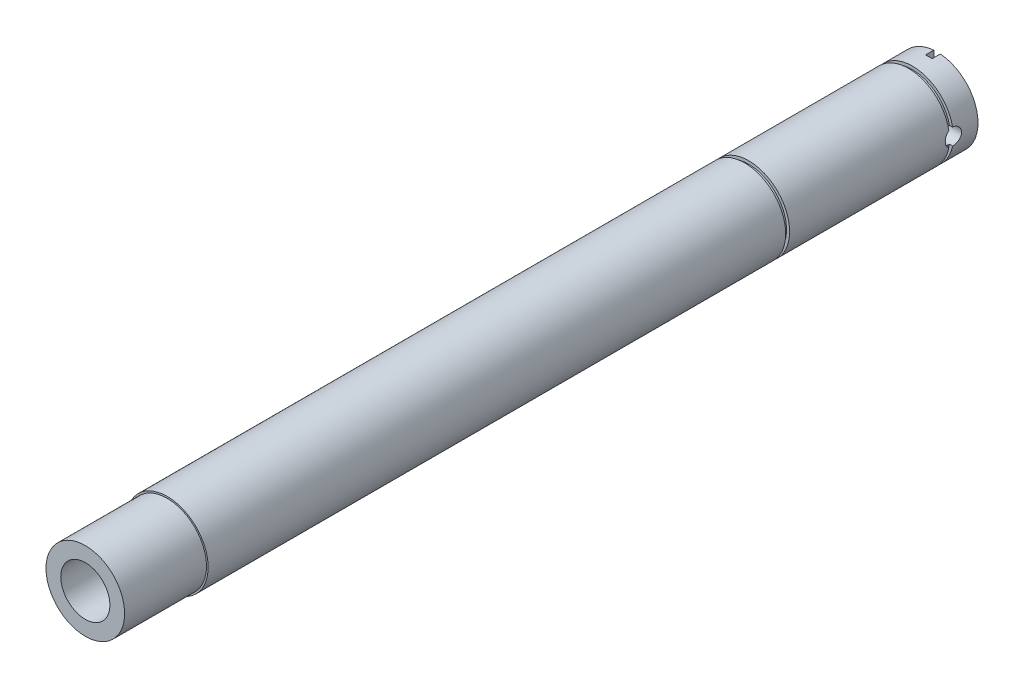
ISO-10303-21;
HEADER;
FILE_DESCRIPTION(('STEP AP214'),'2;1');
FILE_NAME('part.step','',(''),(''),'','','');
FILE_SCHEMA(('AUTOMOTIVE_DESIGN { 1 0 10303 214 1 1 1 1 }'));
ENDSEC;
DATA;
#1=APPLICATION_CONTEXT('core data for automotive mechanical design processes');
#2=APPLICATION_PROTOCOL_DEFINITION('international standard','automotive_design',2000,#1);
#3=PRODUCT_CONTEXT('',#1,'mechanical');
#4=PRODUCT('Part','Part','',(#3));
#5=PRODUCT_RELATED_PRODUCT_CATEGORY('part','',(#4));
#6=PRODUCT_DEFINITION_FORMATION('','',#4);
#7=PRODUCT_DEFINITION_CONTEXT('part definition',#1,'design');
#8=PRODUCT_DEFINITION('design','',#6,#7);
#9=PRODUCT_DEFINITION_SHAPE('','',#8);
#10=(LENGTH_UNIT() NAMED_UNIT(*) SI_UNIT(.MILLI.,.METRE.));
#11=(NAMED_UNIT(*) PLANE_ANGLE_UNIT() SI_UNIT($,.RADIAN.));
#12=(NAMED_UNIT(*) SI_UNIT($,.STERADIAN.) SOLID_ANGLE_UNIT());
#13=UNCERTAINTY_MEASURE_WITH_UNIT(LENGTH_MEASURE(1.E-05),#10,'distance_accuracy_value','');
#14=(GEOMETRIC_REPRESENTATION_CONTEXT(3) GLOBAL_UNCERTAINTY_ASSIGNED_CONTEXT((#13)) GLOBAL_UNIT_ASSIGNED_CONTEXT((#10,
#11,#12)) REPRESENTATION_CONTEXT('',''));
#15=CARTESIAN_POINT('',(0.,0.,0.));
#16=DIRECTION('',(0.,0.,1.));
#17=DIRECTION('',(1.,0.,0.));
#18=AXIS2_PLACEMENT_3D('',#15,#16,#17);
#19=CARTESIAN_POINT('',(-15.875,0.,-259.343504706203));
#20=DIRECTION('',(0.,0.,1.));
#21=DIRECTION('',(1.,0.,0.));
#22=AXIS2_PLACEMENT_3D('',#19,#20,#21);
#23=PLANE('',#22);
#24=DIRECTION('',(-1.,0.,0.));
#25=VECTOR('',#24,1.);
#26=CARTESIAN_POINT('',(-15.875,3.17499999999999,-259.343504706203));
#27=LINE('',#26,#25);
#28=CARTESIAN_POINT('',(15.5542598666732,3.17499999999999,-259.343504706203));
#29=VERTEX_POINT('',#28);
#30=CARTESIAN_POINT('',(14.3337716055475,3.17499999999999,-259.343504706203));
#31=VERTEX_POINT('',#30);
#32=EDGE_CURVE('E310',#29,#31,#27,.T.);
#33=ORIENTED_EDGE('',*,*,#32,.F.);
#34=CARTESIAN_POINT('',(0.,0.,-259.343504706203));
#35=DIRECTION('',(0.,0.,-1.));
#36=DIRECTION('',(-1.,0.,0.));
#37=AXIS2_PLACEMENT_3D('',#34,#35,#36);
#38=CIRCLE('',#37,15.875);
#39=CARTESIAN_POINT('',(-15.5542598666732,3.17499999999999,-259.343504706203));
#40=VERTEX_POINT('',#39);
#41=EDGE_CURVE('E237',#40,#29,#38,.T.);
#42=ORIENTED_EDGE('',*,*,#41,.F.);
#43=CARTESIAN_POINT('',(-14.3337716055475,3.17499999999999,-259.343504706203));
#44=VERTEX_POINT('',#43);
#45=EDGE_CURVE('E349',#44,#40,#27,.T.);
#46=ORIENTED_EDGE('',*,*,#45,.F.);
#47=CARTESIAN_POINT('',(0.,0.,-259.343504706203));
#48=DIRECTION('',(0.,0.,-1.));
#49=DIRECTION('',(-1.,0.,0.));
#50=AXIS2_PLACEMENT_3D('',#47,#48,#49);
#51=CIRCLE('',#50,14.6812);
#52=EDGE_CURVE('E229',#44,#31,#51,.T.);
#53=ORIENTED_EDGE('',*,*,#52,.T.);
#54=EDGE_LOOP('',(#33,#42,#46,#53));
#55=FACE_BOUND('',#54,.T.);
#56=ADVANCED_FACE('F48',(#55),#23,.T.);
#57=CARTESIAN_POINT('',(-15.875,0.,-257.819504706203));
#58=DIRECTION('',(0.,0.,-1.));
#59=DIRECTION('',(-1.,0.,0.));
#60=AXIS2_PLACEMENT_3D('',#57,#58,#59);
#61=PLANE('',#60);
#62=DIRECTION('',(-1.,0.,0.));
#63=VECTOR('',#62,1.);
#64=CARTESIAN_POINT('',(-15.875,-2.78532744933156,-257.819504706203));
#65=LINE('',#64,#63);
#66=CARTESIAN_POINT('',(15.6287419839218,-2.78532744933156,-257.819504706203));
#67=VERTEX_POINT('',#66);
#68=CARTESIAN_POINT('',(14.4145615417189,-2.78532744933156,-257.819504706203));
#69=VERTEX_POINT('',#68);
#70=EDGE_CURVE('E358',#67,#69,#65,.T.);
#71=ORIENTED_EDGE('',*,*,#70,.F.);
#72=CARTESIAN_POINT('',(0.,0.,-257.819504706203));
#73=DIRECTION('',(0.,0.,-1.));
#74=DIRECTION('',(-1.,0.,0.));
#75=AXIS2_PLACEMENT_3D('',#72,#73,#74);
#76=CIRCLE('',#75,15.875);
#77=CARTESIAN_POINT('',(-15.6287419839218,-2.78532744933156,-257.819504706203));
#78=VERTEX_POINT('',#77);
#79=EDGE_CURVE('E215',#67,#78,#76,.T.);
#80=ORIENTED_EDGE('',*,*,#79,.T.);
#81=CARTESIAN_POINT('',(-14.4145615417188,-2.78532744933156,-257.819504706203));
#82=VERTEX_POINT('',#81);
#83=EDGE_CURVE('E193',#82,#78,#65,.T.);
#84=ORIENTED_EDGE('',*,*,#83,.F.);
#85=CARTESIAN_POINT('',(0.,0.,-257.819504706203));
#86=DIRECTION('',(0.,0.,-1.));
#87=DIRECTION('',(-1.,0.,0.));
#88=AXIS2_PLACEMENT_3D('',#85,#86,#87);
#89=CIRCLE('',#88,14.6812);
#90=EDGE_CURVE('E214',#69,#82,#89,.T.);
#91=ORIENTED_EDGE('',*,*,#90,.F.);
#92=EDGE_LOOP('',(#71,#80,#84,#91));
#93=FACE_BOUND('',#92,.T.);
#94=ADVANCED_FACE('F336',(#93),#61,.T.);
#95=CARTESIAN_POINT('',(0.,0.,-317.264715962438));
#96=DIRECTION('',(0.,0.,-1.));
#97=DIRECTION('',(-1.,0.,0.));
#98=AXIS2_PLACEMENT_3D('',#95,#96,#97);
#99=CYLINDRICAL_SURFACE('',#98,14.6812);
#100=CARTESIAN_POINT('',(-14.4145615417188,2.78532744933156,-257.819504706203));
#101=CARTESIAN_POINT('',(-14.4063409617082,2.82785192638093,-257.897204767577));
#102=CARTESIAN_POINT('',(-14.3985594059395,2.86712987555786,-257.976731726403));
#103=CARTESIAN_POINT('',(-14.3840738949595,2.93894918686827,-258.13890725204));
#104=CARTESIAN_POINT('',(-14.3773704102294,2.97148760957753,-258.221557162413));
#105=CARTESIAN_POINT('',(-14.3653755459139,3.02893648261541,-258.387613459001));
#106=CARTESIAN_POINT('',(-14.3600574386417,3.05399293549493,-258.470967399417));
#107=CARTESIAN_POINT('',(-14.3508041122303,3.0971827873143,-258.639483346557));
#108=CARTESIAN_POINT('',(-14.3468682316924,3.11531949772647,-258.724644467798));
#109=CARTESIAN_POINT('',(-14.3404299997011,3.14482862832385,-258.897917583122));
#110=CARTESIAN_POINT('',(-14.3379574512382,3.15606058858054,-258.986054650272));
#111=CARTESIAN_POINT('',(-14.3346147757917,3.17119273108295,-259.163956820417));
#112=CARTESIAN_POINT('',(-14.333762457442,3.17501144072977,-259.253729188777));
#113=CARTESIAN_POINT('',(-14.3337716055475,3.17499999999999,-259.343504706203));
#114=B_SPLINE_CURVE_WITH_KNOTS('',3,(#100,#101,#102,#103,#104,#105,#106,#107,#108,#109,#110,
#111,#112,#113),.UNSPECIFIED.,.F.,.F.,(4,2,2,2,2,2,4),(0.,0.266795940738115,0.53370799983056,
0.795007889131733,1.05618257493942,1.3225081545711,1.59174447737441),.UNSPECIFIED.);
#115=CARTESIAN_POINT('',(-14.4145615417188,2.78532744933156,-257.819504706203));
#116=VERTEX_POINT('',#115);
#117=EDGE_CURVE('E282',#116,#44,#114,.T.);
#118=ORIENTED_EDGE('',*,*,#117,.F.);
#119=CARTESIAN_POINT('',(14.4145615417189,2.78532744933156,-257.819504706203));
#120=VERTEX_POINT('',#119);
#121=EDGE_CURVE('E206',#116,#120,#89,.T.);
#122=ORIENTED_EDGE('',*,*,#121,.T.);
#123=CARTESIAN_POINT('',(14.3337716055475,3.17499999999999,-259.343504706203));
#124=CARTESIAN_POINT('',(14.3337626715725,3.17501121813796,-259.254547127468));
#125=CARTESIAN_POINT('',(14.3345994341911,3.17126185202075,-259.165591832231));
#126=CARTESIAN_POINT('',(14.3379000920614,3.15632099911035,-258.988317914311));
#127=CARTESIAN_POINT('',(14.3403643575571,3.14512781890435,-258.899999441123));
#128=CARTESIAN_POINT('',(14.3467880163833,3.11568866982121,-258.726500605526));
#129=CARTESIAN_POINT('',(14.3507151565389,3.09759465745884,-258.641293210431));
#130=CARTESIAN_POINT('',(14.3599489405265,3.05450261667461,-258.472757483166));
#131=CARTESIAN_POINT('',(14.3652550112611,3.02950745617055,-258.389428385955));
#132=CARTESIAN_POINT('',(14.3772164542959,2.97223132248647,-258.223542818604));
#133=CARTESIAN_POINT('',(14.3838966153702,2.93981504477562,-258.141034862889));
#134=CARTESIAN_POINT('',(14.3984147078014,2.86785989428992,-257.978210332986));
#135=CARTESIAN_POINT('',(14.4062644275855,2.82824747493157,-257.897927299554));
#136=CARTESIAN_POINT('',(14.4145615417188,2.78532744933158,-257.819504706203));
#137=B_SPLINE_CURVE_WITH_KNOTS('',3,(#123,#124,#125,#126,#127,#128,#129,#130,#131,#132,#133,
#134,#135,#136),.UNSPECIFIED.,.F.,.F.,(4,2,2,2,2,2,4),(0.,0.266786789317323,0.533634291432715,
0.794916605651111,1.05609050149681,1.32247069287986,1.59174453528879),.UNSPECIFIED.);
#138=EDGE_CURVE('E305',#31,#120,#137,.T.);
#139=ORIENTED_EDGE('',*,*,#138,.F.);
#140=ORIENTED_EDGE('',*,*,#52,.F.);
#141=EDGE_LOOP('',(#118,#122,#139,#140));
#142=FACE_BOUND('',#141,.T.);
#143=ADVANCED_FACE('F323',(#142),#99,.T.);
#144=CARTESIAN_POINT('',(-15.875,0.,-268.868504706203));
#145=DIRECTION('',(0.,0.,-1.));
#146=DIRECTION('',(-1.,0.,0.));
#147=AXIS2_PLACEMENT_3D('',#144,#145,#146);
#148=PLANE('',#147);
#149=DIRECTION('',(0.,1.,0.));
#150=VECTOR('',#149,1.);
#151=CARTESIAN_POINT('',(-1.27,0.,-268.868504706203));
#152=LINE('',#151,#150);
#153=CARTESIAN_POINT('',(-1.27,-15.8241184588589,-268.868504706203));
#154=VERTEX_POINT('',#153);
#155=CARTESIAN_POINT('',(-1.27,-9.43995365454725,-268.868504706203));
#156=VERTEX_POINT('',#155);
#157=EDGE_CURVE('E243',#154,#156,#152,.T.);
#158=ORIENTED_EDGE('',*,*,#157,.F.);
#159=CARTESIAN_POINT('',(0.,0.,-268.868504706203));
#160=DIRECTION('',(0.,0.,-1.));
#161=DIRECTION('',(-1.,0.,0.));
#162=AXIS2_PLACEMENT_3D('',#159,#160,#161);
#163=CIRCLE('',#162,15.875);
#164=CARTESIAN_POINT('',(-1.27,15.8241184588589,-268.868504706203));
#165=VERTEX_POINT('',#164);
#166=EDGE_CURVE('E392',#154,#165,#163,.T.);
#167=ORIENTED_EDGE('',*,*,#166,.T.);
#168=CARTESIAN_POINT('',(-1.27,9.43995365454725,-268.868504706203));
#169=VERTEX_POINT('',#168);
#170=EDGE_CURVE('E242',#169,#165,#152,.T.);
#171=ORIENTED_EDGE('',*,*,#170,.F.);
#172=CARTESIAN_POINT('',(0.,0.,-268.868504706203));
#173=DIRECTION('',(0.,0.,-1.));
#174=DIRECTION('',(-1.,0.,0.));
#175=AXIS2_PLACEMENT_3D('',#172,#173,#174);
#176=CIRCLE('',#175,9.525);
#177=EDGE_CURVE('E387',#156,#169,#176,.T.);
#178=ORIENTED_EDGE('',*,*,#177,.F.);
#179=EDGE_LOOP('',(#158,#167,#171,#178));
#180=FACE_BOUND('',#179,.T.);
#181=ADVANCED_FACE('F332',(#180),#148,.T.);
#182=CARTESIAN_POINT('',(0.,0.,-317.264715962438));
#183=DIRECTION('',(0.,0.,-1.));
#184=DIRECTION('',(-1.,0.,0.));
#185=AXIS2_PLACEMENT_3D('',#182,#183,#184);
#186=CYLINDRICAL_SURFACE('',#185,15.875);
#187=CARTESIAN_POINT('',(15.5542598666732,-3.17499999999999,-259.343504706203));
#188=CARTESIAN_POINT('',(15.5542522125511,-3.1750095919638,-259.431850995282));
#189=CARTESIAN_POINT('',(15.5550123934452,-3.17131267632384,-259.520191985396));
#190=CARTESIAN_POINT('',(15.5580117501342,-3.15658023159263,-259.69622402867));
#191=CARTESIAN_POINT('',(15.560250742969,-3.14554561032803,-259.783915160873));
#192=CARTESIAN_POINT('',(15.5661465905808,-3.11623441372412,-259.957897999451));
#193=CARTESIAN_POINT('',(15.569801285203,-3.09796887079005,-260.044191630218));
#194=CARTESIAN_POINT('',(15.5784150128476,-3.0543576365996,-260.214879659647));
#195=CARTESIAN_POINT('',(15.5833740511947,-3.02901191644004,-260.299274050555));
#196=CARTESIAN_POINT('',(15.6000059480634,-2.94260617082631,-260.548740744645));
#197=CARTESIAN_POINT('',(15.6134385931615,-2.87115417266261,-260.71023431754));
#198=CARTESIAN_POINT('',(15.6434706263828,-2.70272473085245,-261.018875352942));
#199=CARTESIAN_POINT('',(15.6600703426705,-2.6057446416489,-261.166021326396));
#200=CARTESIAN_POINT('',(15.6948273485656,-2.38754004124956,-261.44394773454));
#201=CARTESIAN_POINT('',(15.7130015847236,-2.26602627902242,-261.574499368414));
#202=CARTESIAN_POINT('',(15.748712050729,-2.00282311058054,-261.8135125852));
#203=CARTESIAN_POINT('',(15.7662481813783,-1.86113058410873,-261.921970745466));
#204=CARTESIAN_POINT('',(15.7988892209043,-1.56006830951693,-262.114608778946));
#205=CARTESIAN_POINT('',(15.81397164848,-1.4005554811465,-262.19856919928));
#206=CARTESIAN_POINT('',(15.8398132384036,-1.06934377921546,-262.338405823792));
#207=CARTESIAN_POINT('',(15.8505730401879,-0.897646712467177,-262.394286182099));
#208=CARTESIAN_POINT('',(15.8664375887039,-0.549330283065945,-262.475664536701));
#209=CARTESIAN_POINT('',(15.8716148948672,-0.372805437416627,-262.501552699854));
#210=CARTESIAN_POINT('',(15.8759817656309,-0.0178431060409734,-262.523429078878));
#211=CARTESIAN_POINT('',(15.8751717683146,0.160594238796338,-262.519419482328));
#212=CARTESIAN_POINT('',(15.8677112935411,0.511626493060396,-262.481909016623));
#213=CARTESIAN_POINT('',(15.8611441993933,0.684268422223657,-262.448829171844));
#214=CARTESIAN_POINT('',(15.8430015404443,1.02149912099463,-262.354785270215));
#215=CARTESIAN_POINT('',(15.8314258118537,1.18608762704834,-262.293820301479));
#216=CARTESIAN_POINT('',(15.804428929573,1.50374436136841,-262.145345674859));
#217=CARTESIAN_POINT('',(15.7889839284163,1.65673318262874,-262.057670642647));
#218=CARTESIAN_POINT('',(15.7559518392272,1.94597794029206,-261.85838959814));
#219=CARTESIAN_POINT('',(15.7383645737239,2.08223248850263,-261.746781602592));
#220=CARTESIAN_POINT('',(15.7026304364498,2.33662920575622,-261.500509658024));
#221=CARTESIAN_POINT('',(15.6844791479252,2.45441690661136,-261.365479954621));
#222=CARTESIAN_POINT('',(15.6499466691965,2.66576460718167,-261.077357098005));
#223=CARTESIAN_POINT('',(15.6335659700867,2.75931789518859,-260.924258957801));
#224=CARTESIAN_POINT('',(15.6044179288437,2.91966635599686,-260.603813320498));
#225=CARTESIAN_POINT('',(15.5916604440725,2.98638873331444,-260.436428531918));
#226=CARTESIAN_POINT('',(15.5713481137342,3.0905675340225,-260.092618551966));
#227=CARTESIAN_POINT('',(15.5637855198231,3.12806755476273,-259.916207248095));
#228=CARTESIAN_POINT('',(15.5576008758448,3.15859457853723,-259.672571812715));
#229=CARTESIAN_POINT('',(15.5563493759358,3.16474873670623,-259.606857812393));
#230=CARTESIAN_POINT('',(15.55467956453,3.17294629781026,-259.475273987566));
#231=CARTESIAN_POINT('',(15.5542598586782,3.17499658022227,-259.409404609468));
#232=CARTESIAN_POINT('',(15.5542598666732,3.17499999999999,-259.343504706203));
#233=B_SPLINE_CURVE_WITH_KNOTS('',3,(#187,#188,#189,#190,#191,#192,#193,#194,#195,#196,#197,
#198,#199,#200,#201,#202,#203,#204,#205,#206,#207,#208,#209,#210,#211,#212,#213,#214,#215,#216,
#217,#218,#219,#220,#221,#222,#223,#224,#225,#226,#227,#228,#229,#230,#231,#232),.UNSPECIFIED.,
.F.,.F.,(4,2,2,2,2,2,2,2,2,2,2,2,2,2,2,2,2,2,2,2,2,2,4),(0.,0.264949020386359,0.529865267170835,
0.794378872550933,1.05889355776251,1.58750877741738,2.11617880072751,2.65148989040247,
3.18688384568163,3.72693619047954,4.26690861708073,4.79977477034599,5.33260193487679,
5.85783704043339,6.38308932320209,6.91166215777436,7.44027881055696,7.9780485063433,
8.51596697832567,9.05533519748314,9.59389717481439,9.79183489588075,9.98944052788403),.UNSPECIFIED.);
#234=CARTESIAN_POINT('',(15.5542598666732,-3.17499999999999,-259.343504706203));
#235=VERTEX_POINT('',#234);
#236=EDGE_CURVE('E312',#235,#29,#233,.T.);
#237=ORIENTED_EDGE('',*,*,#236,.F.);
#238=CARTESIAN_POINT('',(-15.5542598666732,-3.17499999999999,-259.343504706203));
#239=VERTEX_POINT('',#238);
#240=EDGE_CURVE('E233',#235,#239,#38,.T.);
#241=ORIENTED_EDGE('',*,*,#240,.T.);
#242=CARTESIAN_POINT('',(-15.5542598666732,3.17499999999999,-259.343504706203));
#243=CARTESIAN_POINT('',(-15.5542522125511,3.1750095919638,-259.431850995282));
#244=CARTESIAN_POINT('',(-15.5550123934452,3.17131267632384,-259.520191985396));
#245=CARTESIAN_POINT('',(-15.5580117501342,3.15658023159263,-259.69622402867));
#246=CARTESIAN_POINT('',(-15.560250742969,3.14554561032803,-259.783915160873));
#247=CARTESIAN_POINT('',(-15.5661465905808,3.11623441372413,-259.957897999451));
#248=CARTESIAN_POINT('',(-15.569801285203,3.09796887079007,-260.044191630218));
#249=CARTESIAN_POINT('',(-15.5784150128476,3.05435763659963,-260.214879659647));
#250=CARTESIAN_POINT('',(-15.5833740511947,3.02901191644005,-260.299274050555));
#251=CARTESIAN_POINT('',(-15.6000059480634,2.9426061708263,-260.548740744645));
#252=CARTESIAN_POINT('',(-15.6134385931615,2.87115417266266,-260.71023431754));
#253=CARTESIAN_POINT('',(-15.6434706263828,2.70272473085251,-261.018875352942));
#254=CARTESIAN_POINT('',(-15.6600703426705,2.60574464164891,-261.166021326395));
#255=CARTESIAN_POINT('',(-15.6948273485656,2.38754004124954,-261.44394773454));
#256=CARTESIAN_POINT('',(-15.7130015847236,2.26602627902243,-261.574499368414));
#257=CARTESIAN_POINT('',(-15.748712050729,2.00282311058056,-261.8135125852));
#258=CARTESIAN_POINT('',(-15.7662481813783,1.86113058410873,-261.921970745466));
#259=CARTESIAN_POINT('',(-15.7988892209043,1.56006830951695,-262.114608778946));
#260=CARTESIAN_POINT('',(-15.81397164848,1.40055548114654,-262.19856919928));
#261=CARTESIAN_POINT('',(-15.8398132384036,1.0693437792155,-262.338405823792));
#262=CARTESIAN_POINT('',(-15.8505730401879,0.897646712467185,-262.394286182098));
#263=CARTESIAN_POINT('',(-15.8664375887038,0.549330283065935,-262.475664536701));
#264=CARTESIAN_POINT('',(-15.8716148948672,0.372805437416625,-262.501552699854));
#265=CARTESIAN_POINT('',(-15.8759817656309,0.0178431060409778,-262.523429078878));
#266=CARTESIAN_POINT('',(-15.8751717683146,-0.160594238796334,-262.519419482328));
#267=CARTESIAN_POINT('',(-15.8677112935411,-0.511626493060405,-262.481909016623));
#268=CARTESIAN_POINT('',(-15.8611441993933,-0.684268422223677,-262.448829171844));
#269=CARTESIAN_POINT('',(-15.8430015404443,-1.02149912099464,-262.354785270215));
#270=CARTESIAN_POINT('',(-15.8314258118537,-1.18608762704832,-262.293820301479));
#271=CARTESIAN_POINT('',(-15.804428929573,-1.50374436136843,-262.145345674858));
#272=CARTESIAN_POINT('',(-15.7889839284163,-1.65673318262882,-262.057670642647));
#273=CARTESIAN_POINT('',(-15.7559518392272,-1.94597794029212,-261.85838959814));
#274=CARTESIAN_POINT('',(-15.7383645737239,-2.08223248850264,-261.746781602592));
#275=CARTESIAN_POINT('',(-15.7026304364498,-2.33662920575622,-261.500509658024));
#276=CARTESIAN_POINT('',(-15.6844791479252,-2.45441690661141,-261.365479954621));
#277=CARTESIAN_POINT('',(-15.6499466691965,-2.66576460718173,-261.077357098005));
#278=CARTESIAN_POINT('',(-15.6335659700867,-2.7593178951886,-260.924258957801));
#279=CARTESIAN_POINT('',(-15.6044179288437,-2.91966635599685,-260.603813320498));
#280=CARTESIAN_POINT('',(-15.5916604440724,-2.98638873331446,-260.436428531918));
#281=CARTESIAN_POINT('',(-15.5713481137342,-3.09056753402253,-260.092618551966));
#282=CARTESIAN_POINT('',(-15.5637855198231,-3.12806755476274,-259.916207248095));
#283=CARTESIAN_POINT('',(-15.5576008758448,-3.15859457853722,-259.672571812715));
#284=CARTESIAN_POINT('',(-15.5563493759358,-3.16474873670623,-259.606857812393));
#285=CARTESIAN_POINT('',(-15.55467956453,-3.17294629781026,-259.475273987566));
#286=CARTESIAN_POINT('',(-15.5542598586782,-3.17499658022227,-259.409404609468));
#287=CARTESIAN_POINT('',(-15.5542598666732,-3.17499999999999,-259.343504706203));
#288=B_SPLINE_CURVE_WITH_KNOTS('',3,(#242,#243,#244,#245,#246,#247,#248,#249,#250,#251,#252,
#253,#254,#255,#256,#257,#258,#259,#260,#261,#262,#263,#264,#265,#266,#267,#268,#269,#270,#271,
#272,#273,#274,#275,#276,#277,#278,#279,#280,#281,#282,#283,#284,#285,#286,#287),.UNSPECIFIED.,
.F.,.F.,(4,2,2,2,2,2,2,2,2,2,2,2,2,2,2,2,2,2,2,2,2,2,4),(0.,0.264949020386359,0.529865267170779,
0.794378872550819,1.0588935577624,1.58750877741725,2.11617880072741,2.65148989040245,
3.18688384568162,3.72693619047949,4.26690861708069,4.79977477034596,5.33260193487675,
5.85783704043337,6.3830893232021,6.91166215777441,7.44027881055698,7.97804850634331,
8.51596697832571,9.05533519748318,9.59389717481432,9.79183489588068,9.98944052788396),.UNSPECIFIED.);
#289=EDGE_CURVE('E289',#40,#239,#288,.T.);
#290=ORIENTED_EDGE('',*,*,#289,.F.);
#291=ORIENTED_EDGE('',*,*,#41,.T.);
#292=EDGE_LOOP('',(#237,#241,#290,#291));
#293=FACE_BOUND('',#292,.T.);
#294=DIRECTION('',(0.,0.,-1.));
#295=VECTOR('',#294,1.);
#296=CARTESIAN_POINT('',(1.26999999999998,-15.8241184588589,-317.264715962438));
#297=LINE('',#296,#295);
#298=CARTESIAN_POINT('',(1.27,-15.8241184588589,-268.868504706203));
#299=VERTEX_POINT('',#298);
#300=CARTESIAN_POINT('',(1.27000000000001,-15.8241184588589,-265.693504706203));
#301=VERTEX_POINT('',#300);
#302=EDGE_CURVE('E413',#299,#301,#297,.F.);
#303=ORIENTED_EDGE('',*,*,#302,.F.);
#304=CARTESIAN_POINT('',(1.27,15.8241184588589,-268.868504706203));
#305=VERTEX_POINT('',#304);
#306=EDGE_CURVE('E391',#305,#299,#163,.T.);
#307=ORIENTED_EDGE('',*,*,#306,.F.);
#308=DIRECTION('',(0.,0.,-1.));
#309=VECTOR('',#308,1.);
#310=CARTESIAN_POINT('',(1.26999999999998,15.8241184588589,-317.264715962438));
#311=LINE('',#310,#309);
#312=CARTESIAN_POINT('',(1.27,15.8241184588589,-265.693504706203));
#313=VERTEX_POINT('',#312);
#314=EDGE_CURVE('E81',#313,#305,#311,.T.);
#315=ORIENTED_EDGE('',*,*,#314,.F.);
#316=CARTESIAN_POINT('',(0.,0.,-265.693504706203));
#317=DIRECTION('',(0.,0.,1.));
#318=DIRECTION('',(1.,0.,0.));
#319=AXIS2_PLACEMENT_3D('',#316,#317,#318);
#320=CIRCLE('',#319,15.875);
#321=CARTESIAN_POINT('',(-1.27,15.8241184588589,-265.693504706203));
#322=VERTEX_POINT('',#321);
#323=EDGE_CURVE('E399',#322,#313,#320,.F.);
#324=ORIENTED_EDGE('',*,*,#323,.F.);
#325=DIRECTION('',(0.,0.,-1.));
#326=VECTOR('',#325,1.);
#327=CARTESIAN_POINT('',(-1.26999999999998,15.8241184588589,-317.264715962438));
#328=LINE('',#327,#326);
#329=EDGE_CURVE('E406',#165,#322,#328,.F.);
#330=ORIENTED_EDGE('',*,*,#329,.F.);
#331=ORIENTED_EDGE('',*,*,#166,.F.);
#332=DIRECTION('',(0.,0.,-1.));
#333=VECTOR('',#332,1.);
#334=CARTESIAN_POINT('',(-1.26999999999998,-15.8241184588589,-317.264715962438));
#335=LINE('',#334,#333);
#336=CARTESIAN_POINT('',(-1.27,-15.8241184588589,-265.693504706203));
#337=VERTEX_POINT('',#336);
#338=EDGE_CURVE('E400',#337,#154,#335,.T.);
#339=ORIENTED_EDGE('',*,*,#338,.F.);
#340=EDGE_CURVE('E396',#301,#337,#320,.F.);
#341=ORIENTED_EDGE('',*,*,#340,.F.);
#342=EDGE_LOOP('',(#303,#307,#315,#324,#330,#331,#339,#341));
#343=FACE_BOUND('',#342,.T.);
#344=ADVANCED_FACE('F50',(#293,#343),#186,.T.);
#345=DIRECTION('',(-1.,0.,0.));
#346=VECTOR('',#345,1.);
#347=CARTESIAN_POINT('',(-15.875,-3.17499999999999,-259.343504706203));
#348=LINE('',#347,#346);
#349=CARTESIAN_POINT('',(-14.3337716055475,-3.17499999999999,-259.343504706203));
#350=VERTEX_POINT('',#349);
#351=EDGE_CURVE('E360',#239,#350,#348,.F.);
#352=ORIENTED_EDGE('',*,*,#351,.F.);
#353=ORIENTED_EDGE('',*,*,#240,.F.);
#354=CARTESIAN_POINT('',(14.3337716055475,-3.17499999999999,-259.343504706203));
#355=VERTEX_POINT('',#354);
#356=EDGE_CURVE('E311',#355,#235,#348,.F.);
#357=ORIENTED_EDGE('',*,*,#356,.F.);
#358=EDGE_CURVE('E228',#355,#350,#51,.T.);
#359=ORIENTED_EDGE('',*,*,#358,.T.);
#360=EDGE_LOOP('',(#352,#353,#357,#359));
#361=FACE_BOUND('',#360,.T.);
#362=ADVANCED_FACE('F321',(#361),#23,.T.);
#363=CARTESIAN_POINT('',(14.4145615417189,-2.78532744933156,-257.819504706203));
#364=CARTESIAN_POINT('',(14.4063409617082,-2.82785192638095,-257.897204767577));
#365=CARTESIAN_POINT('',(14.3985594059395,-2.86712987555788,-257.976731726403));
#366=CARTESIAN_POINT('',(14.3840738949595,-2.93894918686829,-258.13890725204));
#367=CARTESIAN_POINT('',(14.3773704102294,-2.97148760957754,-258.221557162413));
#368=CARTESIAN_POINT('',(14.3653755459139,-3.02893648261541,-258.387613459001));
#369=CARTESIAN_POINT('',(14.3600574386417,-3.05399293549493,-258.470967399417));
#370=CARTESIAN_POINT('',(14.3508041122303,-3.0971827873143,-258.639483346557));
#371=CARTESIAN_POINT('',(14.3468682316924,-3.11531949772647,-258.724644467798));
#372=CARTESIAN_POINT('',(14.3404299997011,-3.14482862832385,-258.897917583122));
#373=CARTESIAN_POINT('',(14.3379574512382,-3.15606058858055,-258.986054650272));
#374=CARTESIAN_POINT('',(14.3346147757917,-3.17119273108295,-259.163956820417));
#375=CARTESIAN_POINT('',(14.333762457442,-3.17501144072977,-259.253729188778));
#376=CARTESIAN_POINT('',(14.3337716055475,-3.17499999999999,-259.343504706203));
#377=B_SPLINE_CURVE_WITH_KNOTS('',3,(#363,#364,#365,#366,#367,#368,#369,#370,#371,#372,#373,
#374,#375,#376),.UNSPECIFIED.,.F.,.F.,(4,2,2,2,2,2,4),(0.,0.266795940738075,0.53370799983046,
0.795007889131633,1.05618257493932,1.32250815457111,1.59174447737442),.UNSPECIFIED.);
#378=EDGE_CURVE('E300',#69,#355,#377,.T.);
#379=ORIENTED_EDGE('',*,*,#378,.F.);
#380=ORIENTED_EDGE('',*,*,#90,.T.);
#381=CARTESIAN_POINT('',(-14.3337716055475,-3.17499999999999,-259.343504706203));
#382=CARTESIAN_POINT('',(-14.3337626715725,-3.17501121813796,-259.254547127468));
#383=CARTESIAN_POINT('',(-14.3345994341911,-3.17126185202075,-259.165591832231));
#384=CARTESIAN_POINT('',(-14.3379000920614,-3.15632099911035,-258.988317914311));
#385=CARTESIAN_POINT('',(-14.3403643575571,-3.14512781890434,-258.899999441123));
#386=CARTESIAN_POINT('',(-14.3467880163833,-3.11568866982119,-258.726500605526));
#387=CARTESIAN_POINT('',(-14.3507151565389,-3.09759465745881,-258.641293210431));
#388=CARTESIAN_POINT('',(-14.3599489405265,-3.0545026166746,-258.472757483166));
#389=CARTESIAN_POINT('',(-14.3652550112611,-3.02950745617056,-258.389428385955));
#390=CARTESIAN_POINT('',(-14.3772164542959,-2.97223132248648,-258.223542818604));
#391=CARTESIAN_POINT('',(-14.3838966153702,-2.93981504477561,-258.141034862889));
#392=CARTESIAN_POINT('',(-14.3984147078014,-2.86785989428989,-257.978210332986));
#393=CARTESIAN_POINT('',(-14.4062644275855,-2.82824747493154,-257.897927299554));
#394=CARTESIAN_POINT('',(-14.4145615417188,-2.78532744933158,-257.819504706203));
#395=B_SPLINE_CURVE_WITH_KNOTS('',3,(#381,#382,#383,#384,#385,#386,#387,#388,#389,#390,#391,
#392,#393,#394),.UNSPECIFIED.,.F.,.F.,(4,2,2,2,2,2,4),(0.,0.266786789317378,0.533634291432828,
0.794916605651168,1.05609050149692,1.32247069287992,1.59174453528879),.UNSPECIFIED.);
#396=EDGE_CURVE('E274',#350,#82,#395,.T.);
#397=ORIENTED_EDGE('',*,*,#396,.F.);
#398=ORIENTED_EDGE('',*,*,#358,.F.);
#399=EDGE_LOOP('',(#379,#380,#397,#398));
#400=FACE_BOUND('',#399,.T.);
#401=ADVANCED_FACE('F317',(#400),#99,.T.);
#402=DIRECTION('',(-1.,0.,0.));
#403=VECTOR('',#402,1.);
#404=CARTESIAN_POINT('',(-15.875,2.78532744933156,-257.819504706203));
#405=LINE('',#404,#403);
#406=CARTESIAN_POINT('',(-15.6287419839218,2.78532744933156,-257.819504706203));
#407=VERTEX_POINT('',#406);
#408=EDGE_CURVE('E190',#407,#116,#405,.F.);
#409=ORIENTED_EDGE('',*,*,#408,.F.);
#410=CARTESIAN_POINT('',(15.6287419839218,2.78532744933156,-257.819504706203));
#411=VERTEX_POINT('',#410);
#412=EDGE_CURVE('E204',#407,#411,#76,.T.);
#413=ORIENTED_EDGE('',*,*,#412,.T.);
#414=EDGE_CURVE('E208',#120,#411,#405,.F.);
#415=ORIENTED_EDGE('',*,*,#414,.F.);
#416=ORIENTED_EDGE('',*,*,#121,.F.);
#417=EDGE_LOOP('',(#409,#413,#415,#416));
#418=FACE_BOUND('',#417,.T.);
#419=ADVANCED_FACE('F202',(#418),#61,.T.);
#420=CARTESIAN_POINT('',(0.,0.,-317.264715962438));
#421=DIRECTION('',(0.,0.,-1.));
#422=DIRECTION('',(-1.,0.,0.));
#423=AXIS2_PLACEMENT_3D('',#420,#421,#422);
#424=CYLINDRICAL_SURFACE('',#423,15.875);
#425=CARTESIAN_POINT('',(15.6287419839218,2.78532744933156,-257.819504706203));
#426=CARTESIAN_POINT('',(15.636414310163,2.74226854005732,-257.740792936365));
#427=CARTESIAN_POINT('',(15.6444994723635,2.69588059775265,-257.663950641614));
#428=CARTESIAN_POINT('',(15.6612493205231,2.59681177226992,-257.514510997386));
#429=CARTESIAN_POINT('',(15.6699139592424,2.54413140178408,-257.441913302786));
#430=CARTESIAN_POINT('',(15.6875702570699,2.43288413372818,-257.301516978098));
#431=CARTESIAN_POINT('',(15.6965616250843,2.37432239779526,-257.233714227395));
#432=CARTESIAN_POINT('',(15.7146199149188,2.25170983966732,-257.103315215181));
#433=CARTESIAN_POINT('',(15.7236868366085,2.18765902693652,-257.040718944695));
#434=CARTESIAN_POINT('',(15.7506202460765,1.98785687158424,-256.861366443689));
#435=CARTESIAN_POINT('',(15.7682310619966,1.84438522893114,-256.75295760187));
#436=CARTESIAN_POINT('',(15.8007638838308,1.54103323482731,-256.561767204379));
#437=CARTESIAN_POINT('',(15.8156846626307,1.38114544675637,-256.478997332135));
#438=CARTESIAN_POINT('',(15.8411242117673,1.04968830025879,-256.341705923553));
#439=CARTESIAN_POINT('',(15.8516544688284,0.878150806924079,-256.287110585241));
#440=CARTESIAN_POINT('',(15.8632867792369,0.616012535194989,-256.227544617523));
#441=CARTESIAN_POINT('',(15.8664696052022,0.5278903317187,-256.211413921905));
#442=CARTESIAN_POINT('',(15.8713753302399,0.350573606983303,-256.186652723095));
#443=CARTESIAN_POINT('',(15.8730990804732,0.261379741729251,-256.178017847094));
#444=CARTESIAN_POINT('',(15.8746892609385,0.114719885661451,-256.170058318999));
#445=CARTESIAN_POINT('',(15.875000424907,0.0573649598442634,-256.1685035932));
#446=CARTESIAN_POINT('',(15.8749993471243,-0.0881420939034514,-256.168506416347));
#447=CARTESIAN_POINT('',(15.8742630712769,-0.176307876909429,-256.172181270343));
#448=CARTESIAN_POINT('',(15.8713408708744,-0.352020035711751,-256.186845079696));
#449=CARTESIAN_POINT('',(15.8691541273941,-0.439566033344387,-256.197838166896));
#450=CARTESIAN_POINT('',(15.8604822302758,-0.700668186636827,-256.241762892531));
#451=CARTESIAN_POINT('',(15.8518856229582,-0.872453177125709,-256.285639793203));
#452=CARTESIAN_POINT('',(15.8300317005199,-1.20567444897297,-256.401045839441));
#453=CARTESIAN_POINT('',(15.8167828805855,-1.36712896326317,-256.472524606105));
#454=CARTESIAN_POINT('',(15.7870650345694,-1.67578033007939,-256.641047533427));
#455=CARTESIAN_POINT('',(15.7705961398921,-1.82297776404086,-256.738090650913));
#456=CARTESIAN_POINT('',(15.7359877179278,-2.10100976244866,-256.956441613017));
#457=CARTESIAN_POINT('',(15.7178291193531,-2.23160451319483,-257.078050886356));
#458=CARTESIAN_POINT('',(15.6820548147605,-2.47050021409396,-257.341323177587));
#459=CARTESIAN_POINT('',(15.6644381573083,-2.57884238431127,-257.482948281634));
#460=CARTESIAN_POINT('',(15.6447456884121,-2.69405816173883,-257.663028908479));
#461=CARTESIAN_POINT('',(15.6414586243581,-2.7130700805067,-257.693900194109));
#462=CARTESIAN_POINT('',(15.63500670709,-2.75000747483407,-257.75624597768));
#463=CARTESIAN_POINT('',(15.6318417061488,-2.76793427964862,-257.787719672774));
#464=CARTESIAN_POINT('',(15.6287419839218,-2.78532744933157,-257.819504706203));
#465=B_SPLINE_CURVE_WITH_KNOTS('',3,(#425,#426,#427,#428,#429,#430,#431,#432,#433,#434,#435,
#436,#437,#438,#439,#440,#441,#442,#443,#444,#445,#446,#447,#448,#449,#450,#451,#452,#453,#454,
#455,#456,#457,#458,#459,#460,#461,#462,#463,#464),.UNSPECIFIED.,.F.,.F.,(4,2,2,2,2,2,2,2,2,2,2,
2,2,2,2,2,2,2,2,4),(0.,0.270048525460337,0.540075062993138,0.809866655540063,1.07965778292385,
1.61890192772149,2.15839144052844,2.69646051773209,2.96512400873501,3.233630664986,
3.40569378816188,3.67007127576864,3.93459815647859,4.46434890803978,4.99313729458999,
5.5219041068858,6.05760298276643,6.59230041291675,6.70150423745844,6.81057146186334),.UNSPECIFIED.);
#466=EDGE_CURVE('E212',#411,#67,#465,.T.);
#467=ORIENTED_EDGE('',*,*,#466,.F.);
#468=ORIENTED_EDGE('',*,*,#412,.F.);
#469=CARTESIAN_POINT('',(-15.6287419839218,-2.78532744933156,-257.819504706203));
#470=CARTESIAN_POINT('',(-15.636414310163,-2.74226854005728,-257.740792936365));
#471=CARTESIAN_POINT('',(-15.6444994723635,-2.6958805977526,-257.663950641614));
#472=CARTESIAN_POINT('',(-15.6612493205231,-2.59681177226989,-257.514510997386));
#473=CARTESIAN_POINT('',(-15.6699139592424,-2.54413140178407,-257.441913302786));
#474=CARTESIAN_POINT('',(-15.6875702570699,-2.43288413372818,-257.301516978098));
#475=CARTESIAN_POINT('',(-15.6965616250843,-2.37432239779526,-257.233714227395));
#476=CARTESIAN_POINT('',(-15.7146199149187,-2.25170983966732,-257.103315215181));
#477=CARTESIAN_POINT('',(-15.7236868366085,-2.18765902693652,-257.040718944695));
#478=CARTESIAN_POINT('',(-15.7506202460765,-1.98785687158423,-256.861366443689));
#479=CARTESIAN_POINT('',(-15.7682310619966,-1.84438522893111,-256.75295760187));
#480=CARTESIAN_POINT('',(-15.8007638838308,-1.54103323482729,-256.561767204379));
#481=CARTESIAN_POINT('',(-15.8156846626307,-1.38114544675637,-256.478997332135));
#482=CARTESIAN_POINT('',(-15.8411242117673,-1.04968830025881,-256.341705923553));
#483=CARTESIAN_POINT('',(-15.8516544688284,-0.878150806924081,-256.287110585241));
#484=CARTESIAN_POINT('',(-15.8632867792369,-0.616012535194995,-256.227544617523));
#485=CARTESIAN_POINT('',(-15.8664696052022,-0.527890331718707,-256.211413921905));
#486=CARTESIAN_POINT('',(-15.8713753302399,-0.350573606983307,-256.186652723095));
#487=CARTESIAN_POINT('',(-15.8730990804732,-0.261379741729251,-256.178017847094));
#488=CARTESIAN_POINT('',(-15.8746892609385,-0.114719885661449,-256.170058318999));
#489=CARTESIAN_POINT('',(-15.875000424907,-0.0573649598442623,-256.1685035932));
#490=CARTESIAN_POINT('',(-15.8749993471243,0.0881420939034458,-256.168506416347));
#491=CARTESIAN_POINT('',(-15.8742630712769,0.176307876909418,-256.172181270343));
#492=CARTESIAN_POINT('',(-15.8713408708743,0.352020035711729,-256.186845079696));
#493=CARTESIAN_POINT('',(-15.8691541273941,0.439566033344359,-256.197838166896));
#494=CARTESIAN_POINT('',(-15.8604822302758,0.700668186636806,-256.241762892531));
#495=CARTESIAN_POINT('',(-15.8518856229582,0.872453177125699,-256.285639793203));
#496=CARTESIAN_POINT('',(-15.8300317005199,1.20567444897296,-256.401045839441));
#497=CARTESIAN_POINT('',(-15.8167828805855,1.36712896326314,-256.472524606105));
#498=CARTESIAN_POINT('',(-15.7870650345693,1.67578033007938,-256.641047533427));
#499=CARTESIAN_POINT('',(-15.7705961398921,1.82297776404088,-256.738090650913));
#500=CARTESIAN_POINT('',(-15.7359877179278,2.10100976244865,-256.956441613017));
#501=CARTESIAN_POINT('',(-15.7178291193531,2.23160451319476,-257.078050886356));
#502=CARTESIAN_POINT('',(-15.6820548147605,2.47050021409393,-257.341323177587));
#503=CARTESIAN_POINT('',(-15.6644381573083,2.57884238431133,-257.482948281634));
#504=CARTESIAN_POINT('',(-15.6447456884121,2.69405816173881,-257.663028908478));
#505=CARTESIAN_POINT('',(-15.6414586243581,2.71307008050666,-257.693900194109));
#506=CARTESIAN_POINT('',(-15.63500670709,2.75000747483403,-257.75624597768));
#507=CARTESIAN_POINT('',(-15.6318417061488,2.76793427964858,-257.787719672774));
#508=CARTESIAN_POINT('',(-15.6287419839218,2.78532744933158,-257.819504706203));
#509=B_SPLINE_CURVE_WITH_KNOTS('',3,(#469,#470,#471,#472,#473,#474,#475,#476,#477,#478,#479,
#480,#481,#482,#483,#484,#485,#486,#487,#488,#489,#490,#491,#492,#493,#494,#495,#496,#497,#498,
#499,#500,#501,#502,#503,#504,#505,#506,#507,#508),.UNSPECIFIED.,.F.,.F.,(4,2,2,2,2,2,2,2,2,2,2,
2,2,2,2,2,2,2,2,4),(0.,0.270048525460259,0.540075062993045,0.809866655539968,1.07965778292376,
1.61890192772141,2.1583914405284,2.696460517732,2.96512400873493,3.23363066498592,
3.4056937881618,3.67007127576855,3.93459815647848,4.4643489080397,4.99313729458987,
5.52190410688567,6.0576029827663,6.59230041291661,6.70150423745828,6.8105714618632),.UNSPECIFIED.);
#510=EDGE_CURVE('E186',#78,#407,#509,.T.);
#511=ORIENTED_EDGE('',*,*,#510,.F.);
#512=ORIENTED_EDGE('',*,*,#79,.F.);
#513=EDGE_LOOP('',(#467,#468,#511,#512));
#514=FACE_BOUND('',#513,.T.);
#515=CARTESIAN_POINT('',(0.,0.,-195.843504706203));
#516=DIRECTION('',(0.,0.,-1.));
#517=DIRECTION('',(-1.,0.,0.));
#518=AXIS2_PLACEMENT_3D('',#515,#516,#517);
#519=CIRCLE('',#518,15.875);
#520=CARTESIAN_POINT('',(-15.875,0.,-195.843504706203));
#521=VERTEX_POINT('',#520);
#522=EDGE_CURVE('E223',#521,#521,#519,.T.);
#523=ORIENTED_EDGE('',*,*,#522,.T.);
#524=EDGE_LOOP('',(#523));
#525=FACE_BOUND('',#524,.T.);
#526=ADVANCED_FACE('F210',(#514,#525),#424,.T.);
#527=CARTESIAN_POINT('',(-15.875,0.,-195.843504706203));
#528=DIRECTION('',(0.,0.,1.));
#529=DIRECTION('',(1.,0.,0.));
#530=AXIS2_PLACEMENT_3D('',#527,#528,#529);
#531=PLANE('',#530);
#532=CARTESIAN_POINT('',(0.,0.,-195.843504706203));
#533=DIRECTION('',(0.,0.,-1.));
#534=DIRECTION('',(-1.,0.,0.));
#535=AXIS2_PLACEMENT_3D('',#532,#533,#534);
#536=CIRCLE('',#535,14.6812);
#537=CARTESIAN_POINT('',(-14.6812,0.,-195.843504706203));
#538=VERTEX_POINT('',#537);
#539=EDGE_CURVE('E363',#538,#538,#536,.T.);
#540=ORIENTED_EDGE('',*,*,#539,.T.);
#541=EDGE_LOOP('',(#540));
#542=FACE_BOUND('',#541,.T.);
#543=ORIENTED_EDGE('',*,*,#522,.F.);
#544=EDGE_LOOP('',(#543));
#545=FACE_BOUND('',#544,.T.);
#546=ADVANCED_FACE('F627',(#542,#545),#531,.T.);
#547=CARTESIAN_POINT('',(0.,0.,-317.264715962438));
#548=DIRECTION('',(0.,0.,-1.));
#549=DIRECTION('',(-1.,0.,0.));
#550=AXIS2_PLACEMENT_3D('',#547,#548,#549);
#551=CYLINDRICAL_SURFACE('',#550,14.6812);
#552=CARTESIAN_POINT('',(0.,0.,-194.319504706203));
#553=DIRECTION('',(0.,0.,-1.));
#554=DIRECTION('',(-1.,0.,0.));
#555=AXIS2_PLACEMENT_3D('',#552,#553,#554);
#556=CIRCLE('',#555,14.6812);
#557=CARTESIAN_POINT('',(-14.6812,0.,-194.319504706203));
#558=VERTEX_POINT('',#557);
#559=EDGE_CURVE('E361',#558,#558,#556,.T.);
#560=ORIENTED_EDGE('',*,*,#559,.T.);
#561=EDGE_LOOP('',(#560));
#562=FACE_BOUND('',#561,.T.);
#563=ORIENTED_EDGE('',*,*,#539,.F.);
#564=EDGE_LOOP('',(#563));
#565=FACE_BOUND('',#564,.T.);
#566=ADVANCED_FACE('F617',(#562,#565),#551,.T.);
#567=CARTESIAN_POINT('',(-15.875,0.,-194.319504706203));
#568=DIRECTION('',(0.,0.,-1.));
#569=DIRECTION('',(-1.,0.,0.));
#570=AXIS2_PLACEMENT_3D('',#567,#568,#569);
#571=PLANE('',#570);
#572=CARTESIAN_POINT('',(0.,0.,-194.319504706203));
#573=DIRECTION('',(0.,0.,-1.));
#574=DIRECTION('',(-1.,0.,0.));
#575=AXIS2_PLACEMENT_3D('',#572,#573,#574);
#576=CIRCLE('',#575,15.875);
#577=CARTESIAN_POINT('',(-15.875,0.,-194.319504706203));
#578=VERTEX_POINT('',#577);
#579=EDGE_CURVE('E364',#578,#578,#576,.T.);
#580=ORIENTED_EDGE('',*,*,#579,.T.);
#581=EDGE_LOOP('',(#580));
#582=FACE_BOUND('',#581,.T.);
#583=ORIENTED_EDGE('',*,*,#559,.F.);
#584=EDGE_LOOP('',(#583));
#585=FACE_BOUND('',#584,.T.);
#586=ADVANCED_FACE('F607',(#582,#585),#571,.T.);
#587=CARTESIAN_POINT('',(0.,0.,-317.264715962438));
#588=DIRECTION('',(0.,0.,-1.));
#589=DIRECTION('',(-1.,0.,0.));
#590=AXIS2_PLACEMENT_3D('',#587,#588,#589);
#591=CYLINDRICAL_SURFACE('',#590,15.875);
#592=CARTESIAN_POINT('',(0.,0.,29.5814952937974));
#593=DIRECTION('',(0.,0.,-1.));
#594=DIRECTION('',(-1.,0.,0.));
#595=AXIS2_PLACEMENT_3D('',#592,#593,#594);
#596=CIRCLE('',#595,15.875);
#597=CARTESIAN_POINT('',(-15.875,0.,29.5814952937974));
#598=VERTEX_POINT('',#597);
#599=EDGE_CURVE('E372',#598,#598,#596,.T.);
#600=ORIENTED_EDGE('',*,*,#599,.T.);
#601=EDGE_LOOP('',(#600));
#602=FACE_BOUND('',#601,.T.);
#603=ORIENTED_EDGE('',*,*,#579,.F.);
#604=EDGE_LOOP('',(#603));
#605=FACE_BOUND('',#604,.T.);
#606=ADVANCED_FACE('F597',(#602,#605),#591,.T.);
#607=CARTESIAN_POINT('',(-15.875,0.,29.5814952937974));
#608=DIRECTION('',(0.,0.,1.));
#609=DIRECTION('',(1.,0.,0.));
#610=AXIS2_PLACEMENT_3D('',#607,#608,#609);
#611=PLANE('',#610);
#612=CARTESIAN_POINT('',(0.,0.,29.5814952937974));
#613=DIRECTION('',(0.,0.,-1.));
#614=DIRECTION('',(-1.,0.,0.));
#615=AXIS2_PLACEMENT_3D('',#612,#613,#614);
#616=CIRCLE('',#615,15.24);
#617=CARTESIAN_POINT('',(-15.24,0.,29.5814952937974));
#618=VERTEX_POINT('',#617);
#619=EDGE_CURVE('E377',#618,#618,#616,.T.);
#620=ORIENTED_EDGE('',*,*,#619,.T.);
#621=EDGE_LOOP('',(#620));
#622=FACE_BOUND('',#621,.T.);
#623=ORIENTED_EDGE('',*,*,#599,.F.);
#624=EDGE_LOOP('',(#623));
#625=FACE_BOUND('',#624,.T.);
#626=ADVANCED_FACE('F587',(#622,#625),#611,.T.);
#627=CARTESIAN_POINT('',(0.,0.,-317.264715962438));
#628=DIRECTION('',(0.,0.,-1.));
#629=DIRECTION('',(-1.,0.,0.));
#630=AXIS2_PLACEMENT_3D('',#627,#628,#629);
#631=CYLINDRICAL_SURFACE('',#630,15.24);
#632=CARTESIAN_POINT('',(0.,0.,61.3314952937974));
#633=DIRECTION('',(0.,0.,-1.));
#634=DIRECTION('',(-1.,0.,0.));
#635=AXIS2_PLACEMENT_3D('',#632,#633,#634);
#636=CIRCLE('',#635,15.24);
#637=CARTESIAN_POINT('',(-15.24,0.,61.3314952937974));
#638=VERTEX_POINT('',#637);
#639=EDGE_CURVE('E380',#638,#638,#636,.T.);
#640=ORIENTED_EDGE('',*,*,#639,.T.);
#641=EDGE_LOOP('',(#640));
#642=FACE_BOUND('',#641,.T.);
#643=ORIENTED_EDGE('',*,*,#619,.F.);
#644=EDGE_LOOP('',(#643));
#645=FACE_BOUND('',#644,.T.);
#646=ADVANCED_FACE('F577',(#642,#645),#631,.T.);
#647=CARTESIAN_POINT('',(-15.24,0.,61.3314952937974));
#648=DIRECTION('',(0.,0.,1.));
#649=DIRECTION('',(1.,0.,0.));
#650=AXIS2_PLACEMENT_3D('',#647,#648,#649);
#651=PLANE('',#650);
#652=CARTESIAN_POINT('',(0.,0.,61.3314952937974));
#653=DIRECTION('',(0.,0.,-1.));
#654=DIRECTION('',(-1.,0.,0.));
#655=AXIS2_PLACEMENT_3D('',#652,#653,#654);
#656=CIRCLE('',#655,9.52499999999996);
#657=CARTESIAN_POINT('',(-9.52499999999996,0.,61.3314952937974));
#658=VERTEX_POINT('',#657);
#659=EDGE_CURVE('E383',#658,#658,#656,.T.);
#660=ORIENTED_EDGE('',*,*,#659,.T.);
#661=EDGE_LOOP('',(#660));
#662=FACE_BOUND('',#661,.T.);
#663=ORIENTED_EDGE('',*,*,#639,.F.);
#664=EDGE_LOOP('',(#663));
#665=FACE_BOUND('',#664,.T.);
#666=ADVANCED_FACE('F492',(#662,#665),#651,.T.);
#667=CARTESIAN_POINT('',(0.,0.,-317.264715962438));
#668=DIRECTION('',(0.,0.,-1.));
#669=DIRECTION('',(-1.,0.,0.));
#670=AXIS2_PLACEMENT_3D('',#667,#668,#669);
#671=CYLINDRICAL_SURFACE('',#670,9.52499999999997);
#672=CARTESIAN_POINT('',(-9.52499999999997,0.,-256.168504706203));
#673=CARTESIAN_POINT('',(-9.52500048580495,-0.173238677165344,-256.168503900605));
#674=CARTESIAN_POINT('',(-9.52023018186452,-0.34647249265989,-256.182729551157));
#675=CARTESIAN_POINT('',(-9.50167042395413,-0.687837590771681,-256.239082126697));
#676=CARTESIAN_POINT('',(-9.48788003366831,-0.855968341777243,-256.28121194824));
#677=CARTESIAN_POINT('',(-9.45277852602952,-1.18215660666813,-256.391768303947));
#678=CARTESIAN_POINT('',(-9.43147998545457,-1.34023044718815,-256.460150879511));
#679=CARTESIAN_POINT('',(-9.38353615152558,-1.64266542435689,-256.621072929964));
#680=CARTESIAN_POINT('',(-9.35688980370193,-1.78702384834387,-256.713617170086));
#681=CARTESIAN_POINT('',(-9.30002249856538,-2.06292981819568,-256.923601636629));
#682=CARTESIAN_POINT('',(-9.26971591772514,-2.19393674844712,-257.04172887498));
#683=CARTESIAN_POINT('',(-9.20941499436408,-2.4346937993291,-257.298065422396));
#684=CARTESIAN_POINT('',(-9.17942072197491,-2.54443923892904,-257.436279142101));
#685=CARTESIAN_POINT('',(-9.12219830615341,-2.74264419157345,-257.733732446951));
#686=CARTESIAN_POINT('',(-9.09507449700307,-2.83040092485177,-257.893462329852));
#687=CARTESIAN_POINT('',(-9.04796594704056,-2.97757492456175,-258.226463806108));
#688=CARTESIAN_POINT('',(-9.02797902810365,-3.03700083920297,-258.399731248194));
#689=CARTESIAN_POINT('',(-8.99830887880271,-3.12379824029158,-258.748742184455));
#690=CARTESIAN_POINT('',(-8.98830104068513,-3.15218269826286,-258.924205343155));
#691=CARTESIAN_POINT('',(-8.97876209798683,-3.17925806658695,-259.277667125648));
#692=CARTESIAN_POINT('',(-8.97922775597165,-3.17795815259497,-259.455664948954));
#693=CARTESIAN_POINT('',(-8.99029872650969,-3.14648819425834,-259.800503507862));
#694=CARTESIAN_POINT('',(-9.00043970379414,-3.11764017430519,-259.96748238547));
#695=CARTESIAN_POINT('',(-9.02895888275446,-3.03404956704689,-260.294078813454));
#696=CARTESIAN_POINT('',(-9.04733807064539,-2.97930387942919,-260.453695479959));
#697=CARTESIAN_POINT('',(-9.09059367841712,-2.84460650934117,-260.764040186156));
#698=CARTESIAN_POINT('',(-9.11556996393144,-2.76426310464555,-260.914583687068));
#699=CARTESIAN_POINT('',(-9.16916373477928,-2.58092291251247,-261.200469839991));
#700=CARTESIAN_POINT('',(-9.19778227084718,-2.47791958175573,-261.335808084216));
#701=CARTESIAN_POINT('',(-9.25726270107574,-2.24583413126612,-261.594870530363));
#702=CARTESIAN_POINT('',(-9.28816371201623,-2.11567125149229,-261.717619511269));
#703=CARTESIAN_POINT('',(-9.34742029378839,-1.83622813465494,-261.939801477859));
#704=CARTESIAN_POINT('',(-9.37577562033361,-1.68694606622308,-262.039232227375));
#705=CARTESIAN_POINT('',(-9.42711817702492,-1.3714336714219,-262.212740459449));
#706=CARTESIAN_POINT('',(-9.45004936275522,-1.20504990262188,-262.286556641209));
#707=CARTESIAN_POINT('',(-9.48755300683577,-0.861279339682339,-262.404849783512));
#708=CARTESIAN_POINT('',(-9.50212836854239,-0.683896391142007,-262.449336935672));
#709=CARTESIAN_POINT('',(-9.5207971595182,-0.331418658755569,-262.505981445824));
#710=CARTESIAN_POINT('',(-9.52531755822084,-0.156557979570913,-262.519456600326));
#711=CARTESIAN_POINT('',(-9.52464766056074,0.192960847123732,-262.517448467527));
#712=CARTESIAN_POINT('',(-9.51945900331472,0.367619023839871,-262.501970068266));
#713=CARTESIAN_POINT('',(-9.50023578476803,0.706500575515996,-262.443536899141));
#714=CARTESIAN_POINT('',(-9.48646180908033,0.870879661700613,-262.401391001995));
#715=CARTESIAN_POINT('',(-9.45171613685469,1.19016766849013,-262.291830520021));
#716=CARTESIAN_POINT('',(-9.43074352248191,1.34507537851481,-262.224412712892));
#717=CARTESIAN_POINT('',(-9.38304356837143,1.64556534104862,-262.064256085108));
#718=CARTESIAN_POINT('',(-9.35617936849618,1.79079512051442,-261.970897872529));
#719=CARTESIAN_POINT('',(-9.2997418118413,2.06395583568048,-261.76223827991));
#720=CARTESIAN_POINT('',(-9.270167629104,2.19188146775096,-261.646930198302));
#721=CARTESIAN_POINT('',(-9.20993992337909,2.432851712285,-261.391447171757));
#722=CARTESIAN_POINT('',(-9.17929841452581,2.54495607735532,-261.25038041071));
#723=CARTESIAN_POINT('',(-9.12177415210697,2.74401763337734,-260.950779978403));
#724=CARTESIAN_POINT('',(-9.09489142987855,2.83097461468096,-260.792246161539));
#725=CARTESIAN_POINT('',(-9.0481909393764,2.97687025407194,-260.462142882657));
#726=CARTESIAN_POINT('',(-9.02835890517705,3.03586556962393,-260.290600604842));
#727=CARTESIAN_POINT('',(-8.99829392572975,3.12386556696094,-259.939202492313));
#728=CARTESIAN_POINT('',(-8.98805665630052,3.15288375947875,-259.759350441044));
#729=CARTESIAN_POINT('',(-8.9788320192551,3.17905219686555,-259.406378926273));
#730=CARTESIAN_POINT('',(-8.9792937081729,3.17776306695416,-259.233388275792));
#731=CARTESIAN_POINT('',(-8.99005281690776,3.14719428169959,-258.890225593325));
#732=CARTESIAN_POINT('',(-9.00034965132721,3.117916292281,-258.720053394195));
#733=CARTESIAN_POINT('',(-9.02920864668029,3.03330550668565,-258.39057397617));
#734=CARTESIAN_POINT('',(-9.04761011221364,2.97847812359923,-258.231121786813));
#735=CARTESIAN_POINT('',(-9.09054566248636,2.84473448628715,-257.923557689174));
#736=CARTESIAN_POINT('',(-9.11508110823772,2.7658128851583,-257.775448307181));
#737=CARTESIAN_POINT('',(-9.16885482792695,2.58210269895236,-257.487769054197));
#738=CARTESIAN_POINT('',(-9.19825159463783,2.47633567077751,-257.348853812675));
#739=CARTESIAN_POINT('',(-9.25777156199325,2.24359115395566,-257.090239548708));
#740=CARTESIAN_POINT('',(-9.2878949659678,2.11660766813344,-256.970545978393));
#741=CARTESIAN_POINT('',(-9.34688346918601,1.83909194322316,-256.749071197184));
#742=CARTESIAN_POINT('',(-9.37565377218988,1.6878348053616,-256.648169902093));
#743=CARTESIAN_POINT('',(-9.42740021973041,1.36955960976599,-256.473335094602));
#744=CARTESIAN_POINT('',(-9.45037784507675,1.20254559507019,-256.3993946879));
#745=CARTESIAN_POINT('',(-9.48707510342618,0.865167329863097,-256.283688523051));
#746=CARTESIAN_POINT('',(-9.50116249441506,0.695286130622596,-256.240632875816));
#747=CARTESIAN_POINT('',(-9.52012342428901,0.350267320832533,-256.183045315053));
#748=CARTESIAN_POINT('',(-9.52499950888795,0.175131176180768,-256.168505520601));
#749=CARTESIAN_POINT('',(-9.52499999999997,0.,-256.168504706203));
#750=B_SPLINE_CURVE_WITH_KNOTS('',3,(#672,#673,#674,#675,#676,#677,#678,#679,#680,#681,#682,
#683,#684,#685,#686,#687,#688,#689,#690,#691,#692,#693,#694,#695,#696,#697,#698,#699,#700,#701,
#702,#703,#704,#705,#706,#707,#708,#709,#710,#711,#712,#713,#714,#715,#716,#717,#718,#719,#720,
#721,#722,#723,#724,#725,#726,#727,#728,#729,#730,#731,#732,#733,#734,#735,#736,#737,#738,#739,
#740,#741,#742,#743,#744,#745,#746,#747,#748,#749),.UNSPECIFIED.,.T.,.F.,(4,2,2,2,2,2,2,2,2,2,2,
2,2,2,2,2,2,2,2,2,2,2,2,2,2,2,2,2,2,2,2,2,2,2,2,2,2,2,4),(0.,0.519071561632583,1.03819701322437,
1.55645698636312,2.07481924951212,2.60936372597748,3.14402575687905,3.69406121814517,
4.24392866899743,4.77526114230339,5.30642937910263,5.8133242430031,6.32027980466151,
6.83539943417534,7.35066800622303,7.89283745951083,8.43505888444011,8.98265937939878,
9.53006948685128,10.0537512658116,10.5773446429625,11.0857715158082,11.5942632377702,
12.1161301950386,12.638156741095,13.1839024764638,13.7296527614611,14.2742924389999,
14.8186865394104,15.3351123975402,15.8515075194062,16.3580948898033,16.8647947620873,
17.3936046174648,17.9225642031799,18.4721392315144,19.0215736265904,19.5464607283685,
20.0712027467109),.UNSPECIFIED.);
#751=CARTESIAN_POINT('',(-9.52499999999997,0.,-256.168504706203));
#752=VERTEX_POINT('',#751);
#753=EDGE_CURVE('E53',#752,#752,#750,.T.);
#754=ORIENTED_EDGE('',*,*,#753,.F.);
#755=EDGE_LOOP('',(#754));
#756=FACE_BOUND('',#755,.T.);
#757=CARTESIAN_POINT('',(9.52499999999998,0.,-256.168504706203));
#758=CARTESIAN_POINT('',(9.52500048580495,0.173238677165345,-256.168503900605));
#759=CARTESIAN_POINT('',(9.52023018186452,0.346472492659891,-256.182729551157));
#760=CARTESIAN_POINT('',(9.50167042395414,0.68783759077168,-256.239082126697));
#761=CARTESIAN_POINT('',(9.48788003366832,0.855968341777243,-256.28121194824));
#762=CARTESIAN_POINT('',(9.45277852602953,1.18215660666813,-256.391768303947));
#763=CARTESIAN_POINT('',(9.43147998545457,1.34023044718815,-256.460150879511));
#764=CARTESIAN_POINT('',(9.38353615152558,1.64266542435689,-256.621072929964));
#765=CARTESIAN_POINT('',(9.35688980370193,1.78702384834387,-256.713617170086));
#766=CARTESIAN_POINT('',(9.30002249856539,2.06292981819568,-256.923601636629));
#767=CARTESIAN_POINT('',(9.26971591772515,2.19393674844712,-257.04172887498));
#768=CARTESIAN_POINT('',(9.20941499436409,2.43469379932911,-257.298065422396));
#769=CARTESIAN_POINT('',(9.17942072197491,2.54443923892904,-257.436279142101));
#770=CARTESIAN_POINT('',(9.12219830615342,2.74264419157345,-257.733732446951));
#771=CARTESIAN_POINT('',(9.09507449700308,2.83040092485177,-257.893462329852));
#772=CARTESIAN_POINT('',(9.04796594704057,2.97757492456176,-258.226463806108));
#773=CARTESIAN_POINT('',(9.02797902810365,3.03700083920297,-258.399731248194));
#774=CARTESIAN_POINT('',(8.99830887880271,3.12379824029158,-258.748742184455));
#775=CARTESIAN_POINT('',(8.98830104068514,3.15218269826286,-258.924205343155));
#776=CARTESIAN_POINT('',(8.97876209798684,3.17925806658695,-259.277667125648));
#777=CARTESIAN_POINT('',(8.97922775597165,3.17795815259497,-259.455664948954));
#778=CARTESIAN_POINT('',(8.9902987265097,3.14648819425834,-259.800503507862));
#779=CARTESIAN_POINT('',(9.00043970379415,3.1176401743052,-259.96748238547));
#780=CARTESIAN_POINT('',(9.02895888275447,3.03404956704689,-260.294078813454));
#781=CARTESIAN_POINT('',(9.04733807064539,2.97930387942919,-260.453695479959));
#782=CARTESIAN_POINT('',(9.09059367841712,2.84460650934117,-260.764040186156));
#783=CARTESIAN_POINT('',(9.11556996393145,2.76426310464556,-260.914583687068));
#784=CARTESIAN_POINT('',(9.16916373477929,2.58092291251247,-261.200469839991));
#785=CARTESIAN_POINT('',(9.19778227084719,2.47791958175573,-261.335808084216));
#786=CARTESIAN_POINT('',(9.25726270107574,2.24583413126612,-261.594870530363));
#787=CARTESIAN_POINT('',(9.28816371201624,2.11567125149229,-261.717619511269));
#788=CARTESIAN_POINT('',(9.34742029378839,1.83622813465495,-261.939801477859));
#789=CARTESIAN_POINT('',(9.37577562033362,1.68694606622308,-262.039232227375));
#790=CARTESIAN_POINT('',(9.42711817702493,1.3714336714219,-262.212740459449));
#791=CARTESIAN_POINT('',(9.45004936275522,1.20504990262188,-262.286556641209));
#792=CARTESIAN_POINT('',(9.48755300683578,0.86127933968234,-262.404849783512));
#793=CARTESIAN_POINT('',(9.50212836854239,0.683896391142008,-262.449336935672));
#794=CARTESIAN_POINT('',(9.52079715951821,0.331418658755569,-262.505981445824));
#795=CARTESIAN_POINT('',(9.52531755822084,0.156557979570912,-262.519456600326));
#796=CARTESIAN_POINT('',(9.52464766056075,-0.192960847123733,-262.517448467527));
#797=CARTESIAN_POINT('',(9.51945900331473,-0.367619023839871,-262.501970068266));
#798=CARTESIAN_POINT('',(9.50023578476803,-0.706500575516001,-262.443536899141));
#799=CARTESIAN_POINT('',(9.48646180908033,-0.870879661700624,-262.401391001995));
#800=CARTESIAN_POINT('',(9.4517161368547,-1.19016766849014,-262.291830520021));
#801=CARTESIAN_POINT('',(9.43074352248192,-1.34507537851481,-262.224412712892));
#802=CARTESIAN_POINT('',(9.38304356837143,-1.64556534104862,-262.064256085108));
#803=CARTESIAN_POINT('',(9.35617936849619,-1.79079512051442,-261.970897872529));
#804=CARTESIAN_POINT('',(9.29974181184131,-2.06395583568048,-261.76223827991));
#805=CARTESIAN_POINT('',(9.270167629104,-2.19188146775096,-261.646930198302));
#806=CARTESIAN_POINT('',(9.2099399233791,-2.432851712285,-261.391447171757));
#807=CARTESIAN_POINT('',(9.17929841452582,-2.54495607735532,-261.25038041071));
#808=CARTESIAN_POINT('',(9.12177415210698,-2.74401763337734,-260.950779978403));
#809=CARTESIAN_POINT('',(9.09489142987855,-2.83097461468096,-260.792246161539));
#810=CARTESIAN_POINT('',(9.0481909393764,-2.97687025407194,-260.462142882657));
#811=CARTESIAN_POINT('',(9.02835890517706,-3.03586556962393,-260.290600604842));
#812=CARTESIAN_POINT('',(8.99829392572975,-3.12386556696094,-259.939202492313));
#813=CARTESIAN_POINT('',(8.98805665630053,-3.15288375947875,-259.759350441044));
#814=CARTESIAN_POINT('',(8.9788320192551,-3.17905219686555,-259.406378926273));
#815=CARTESIAN_POINT('',(8.97929370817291,-3.17776306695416,-259.233388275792));
#816=CARTESIAN_POINT('',(8.99005281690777,-3.14719428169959,-258.890225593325));
#817=CARTESIAN_POINT('',(9.00034965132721,-3.11791629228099,-258.720053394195));
#818=CARTESIAN_POINT('',(9.02920864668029,-3.03330550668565,-258.39057397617));
#819=CARTESIAN_POINT('',(9.04761011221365,-2.97847812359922,-258.231121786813));
#820=CARTESIAN_POINT('',(9.09054566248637,-2.84473448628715,-257.923557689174));
#821=CARTESIAN_POINT('',(9.11508110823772,-2.76581288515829,-257.775448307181));
#822=CARTESIAN_POINT('',(9.16885482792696,-2.58210269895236,-257.487769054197));
#823=CARTESIAN_POINT('',(9.19825159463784,-2.47633567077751,-257.348853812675));
#824=CARTESIAN_POINT('',(9.25777156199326,-2.24359115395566,-257.090239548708));
#825=CARTESIAN_POINT('',(9.2878949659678,-2.11660766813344,-256.970545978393));
#826=CARTESIAN_POINT('',(9.34688346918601,-1.83909194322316,-256.749071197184));
#827=CARTESIAN_POINT('',(9.37565377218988,-1.6878348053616,-256.648169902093));
#828=CARTESIAN_POINT('',(9.42740021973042,-1.36955960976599,-256.473335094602));
#829=CARTESIAN_POINT('',(9.45037784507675,-1.20254559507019,-256.3993946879));
#830=CARTESIAN_POINT('',(9.48707510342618,-0.865167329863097,-256.283688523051));
#831=CARTESIAN_POINT('',(9.50116249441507,-0.695286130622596,-256.240632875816));
#832=CARTESIAN_POINT('',(9.52012342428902,-0.350267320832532,-256.183045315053));
#833=CARTESIAN_POINT('',(9.52499950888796,-0.175131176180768,-256.168505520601));
#834=CARTESIAN_POINT('',(9.52499999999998,0.,-256.168504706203));
#835=B_SPLINE_CURVE_WITH_KNOTS('',3,(#757,#758,#759,#760,#761,#762,#763,#764,#765,#766,#767,
#768,#769,#770,#771,#772,#773,#774,#775,#776,#777,#778,#779,#780,#781,#782,#783,#784,#785,#786,
#787,#788,#789,#790,#791,#792,#793,#794,#795,#796,#797,#798,#799,#800,#801,#802,#803,#804,#805,
#806,#807,#808,#809,#810,#811,#812,#813,#814,#815,#816,#817,#818,#819,#820,#821,#822,#823,#824,
#825,#826,#827,#828,#829,#830,#831,#832,#833,#834),.UNSPECIFIED.,.T.,.F.,(4,2,2,2,2,2,2,2,2,2,2,
2,2,2,2,2,2,2,2,2,2,2,2,2,2,2,2,2,2,2,2,2,2,2,2,2,2,2,4),(0.,0.519071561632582,1.03819701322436,
1.55645698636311,2.07481924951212,2.60936372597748,3.14402575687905,3.69406121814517,
4.24392866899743,4.77526114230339,5.30642937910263,5.8133242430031,6.32027980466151,
6.83539943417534,7.35066800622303,7.89283745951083,8.43505888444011,8.98265937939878,
9.53006948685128,10.0537512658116,10.5773446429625,11.0857715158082,11.5942632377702,
12.1161301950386,12.638156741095,13.1839024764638,13.7296527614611,14.2742924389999,
14.8186865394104,15.3351123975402,15.8515075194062,16.3580948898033,16.8647947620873,
17.3936046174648,17.9225642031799,18.4721392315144,19.0215736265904,19.5464607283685,
20.0712027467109),.UNSPECIFIED.);
#836=CARTESIAN_POINT('',(9.52499999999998,0.,-256.168504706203));
#837=VERTEX_POINT('',#836);
#838=EDGE_CURVE('E245',#837,#837,#835,.T.);
#839=ORIENTED_EDGE('',*,*,#838,.F.);
#840=EDGE_LOOP('',(#839));
#841=FACE_BOUND('',#840,.T.);
#842=DIRECTION('',(0.,0.,-1.));
#843=VECTOR('',#842,1.);
#844=CARTESIAN_POINT('',(-1.26999999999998,9.43995365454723,-317.264715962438));
#845=LINE('',#844,#843);
#846=CARTESIAN_POINT('',(-1.27,9.43995365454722,-265.693504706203));
#847=VERTEX_POINT('',#846);
#848=EDGE_CURVE('E408',#847,#169,#845,.T.);
#849=ORIENTED_EDGE('',*,*,#848,.F.);
#850=CARTESIAN_POINT('',(0.,0.,-265.693504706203));
#851=DIRECTION('',(0.,0.,1.));
#852=DIRECTION('',(1.,0.,0.));
#853=AXIS2_PLACEMENT_3D('',#850,#851,#852);
#854=CIRCLE('',#853,9.52499999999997);
#855=CARTESIAN_POINT('',(1.27,9.43995365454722,-265.693504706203));
#856=VERTEX_POINT('',#855);
#857=EDGE_CURVE('E12',#856,#847,#854,.T.);
#858=ORIENTED_EDGE('',*,*,#857,.F.);
#859=DIRECTION('',(0.,0.,-1.));
#860=VECTOR('',#859,1.);
#861=CARTESIAN_POINT('',(1.26999999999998,9.43995365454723,-317.264715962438));
#862=LINE('',#861,#860);
#863=CARTESIAN_POINT('',(1.27,9.43995365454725,-268.868504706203));
#864=VERTEX_POINT('',#863);
#865=EDGE_CURVE('E411',#864,#856,#862,.F.);
#866=ORIENTED_EDGE('',*,*,#865,.F.);
#867=CARTESIAN_POINT('',(1.27,-9.43995365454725,-268.868504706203));
#868=VERTEX_POINT('',#867);
#869=EDGE_CURVE('E386',#864,#868,#176,.T.);
#870=ORIENTED_EDGE('',*,*,#869,.T.);
#871=DIRECTION('',(0.,0.,-1.));
#872=VECTOR('',#871,1.);
#873=CARTESIAN_POINT('',(1.26999999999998,-9.43995365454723,-317.264715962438));
#874=LINE('',#873,#872);
#875=CARTESIAN_POINT('',(1.27000000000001,-9.43995365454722,-265.693504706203));
#876=VERTEX_POINT('',#875);
#877=EDGE_CURVE('E73',#876,#868,#874,.T.);
#878=ORIENTED_EDGE('',*,*,#877,.F.);
#879=CARTESIAN_POINT('',(-1.27,-9.43995365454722,-265.693504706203));
#880=VERTEX_POINT('',#879);
#881=EDGE_CURVE('E62',#880,#876,#854,.T.);
#882=ORIENTED_EDGE('',*,*,#881,.F.);
#883=DIRECTION('',(0.,0.,-1.));
#884=VECTOR('',#883,1.);
#885=CARTESIAN_POINT('',(-1.26999999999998,-9.43995365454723,-317.264715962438));
#886=LINE('',#885,#884);
#887=EDGE_CURVE('E403',#156,#880,#886,.F.);
#888=ORIENTED_EDGE('',*,*,#887,.F.);
#889=ORIENTED_EDGE('',*,*,#177,.T.);
#890=EDGE_LOOP('',(#849,#858,#866,#870,#878,#882,#888,#889));
#891=FACE_BOUND('',#890,.T.);
#892=ORIENTED_EDGE('',*,*,#659,.F.);
#893=EDGE_LOOP('',(#892));
#894=FACE_BOUND('',#893,.T.);
#895=ADVANCED_FACE('F250',(#756,#841,#891,#894),#671,.F.);
#896=DIRECTION('',(0.,-1.,0.));
#897=VECTOR('',#896,1.);
#898=CARTESIAN_POINT('',(1.27,0.,-268.868504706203));
#899=LINE('',#898,#897);
#900=EDGE_CURVE('E241',#305,#864,#899,.T.);
#901=ORIENTED_EDGE('',*,*,#900,.F.);
#902=ORIENTED_EDGE('',*,*,#306,.T.);
#903=EDGE_CURVE('E238',#868,#299,#899,.T.);
#904=ORIENTED_EDGE('',*,*,#903,.F.);
#905=ORIENTED_EDGE('',*,*,#869,.F.);
#906=EDGE_LOOP('',(#901,#902,#904,#905));
#907=FACE_BOUND('',#906,.T.);
#908=ADVANCED_FACE('F467',(#907),#148,.T.);
#909=CARTESIAN_POINT('',(-1.27,-15.875,-272.043504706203));
#910=DIRECTION('',(-1.,0.,0.));
#911=DIRECTION('',(0.,0.,1.));
#912=AXIS2_PLACEMENT_3D('',#909,#910,#911);
#913=PLANE('',#912);
#914=ORIENTED_EDGE('',*,*,#338,.T.);
#915=ORIENTED_EDGE('',*,*,#157,.T.);
#916=ORIENTED_EDGE('',*,*,#887,.T.);
#917=DIRECTION('',(0.,1.,0.));
#918=VECTOR('',#917,1.);
#919=CARTESIAN_POINT('',(-1.27,-15.875,-265.693504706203));
#920=LINE('',#919,#918);
#921=EDGE_CURVE('E421',#337,#880,#920,.T.);
#922=ORIENTED_EDGE('',*,*,#921,.F.);
#923=EDGE_LOOP('',(#914,#915,#916,#922));
#924=FACE_BOUND('',#923,.T.);
#925=ADVANCED_FACE('F471',(#924),#913,.F.);
#926=CARTESIAN_POINT('',(1.27,-15.875,-272.043504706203));
#927=DIRECTION('',(1.,0.,0.));
#928=DIRECTION('',(0.,0.,-1.));
#929=AXIS2_PLACEMENT_3D('',#926,#927,#928);
#930=PLANE('',#929);
#931=ORIENTED_EDGE('',*,*,#302,.T.);
#932=DIRECTION('',(0.,1.,0.));
#933=VECTOR('',#932,1.);
#934=CARTESIAN_POINT('',(1.27,-15.875,-265.693504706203));
#935=LINE('',#934,#933);
#936=EDGE_CURVE('E418',#301,#876,#935,.T.);
#937=ORIENTED_EDGE('',*,*,#936,.T.);
#938=ORIENTED_EDGE('',*,*,#877,.T.);
#939=ORIENTED_EDGE('',*,*,#903,.T.);
#940=EDGE_LOOP('',(#931,#937,#938,#939));
#941=FACE_BOUND('',#940,.T.);
#942=ADVANCED_FACE('F260',(#941),#930,.F.);
#943=CARTESIAN_POINT('',(-1.27,-15.875,-265.693504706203));
#944=DIRECTION('',(0.,0.,1.));
#945=DIRECTION('',(1.,0.,0.));
#946=AXIS2_PLACEMENT_3D('',#943,#944,#945);
#947=PLANE('',#946);
#948=ORIENTED_EDGE('',*,*,#340,.T.);
#949=ORIENTED_EDGE('',*,*,#921,.T.);
#950=ORIENTED_EDGE('',*,*,#881,.T.);
#951=ORIENTED_EDGE('',*,*,#936,.F.);
#952=EDGE_LOOP('',(#948,#949,#950,#951));
#953=FACE_BOUND('',#952,.T.);
#954=ADVANCED_FACE('F430',(#953),#947,.F.);
#955=ORIENTED_EDGE('',*,*,#323,.T.);
#956=EDGE_CURVE('E422',#856,#313,#935,.T.);
#957=ORIENTED_EDGE('',*,*,#956,.F.);
#958=ORIENTED_EDGE('',*,*,#857,.T.);
#959=EDGE_CURVE('E419',#847,#322,#920,.T.);
#960=ORIENTED_EDGE('',*,*,#959,.T.);
#961=EDGE_LOOP('',(#955,#957,#958,#960));
#962=FACE_BOUND('',#961,.T.);
#963=ADVANCED_FACE('F477',(#962),#947,.F.);
#964=ORIENTED_EDGE('',*,*,#314,.T.);
#965=ORIENTED_EDGE('',*,*,#900,.T.);
#966=ORIENTED_EDGE('',*,*,#865,.T.);
#967=ORIENTED_EDGE('',*,*,#956,.T.);
#968=EDGE_LOOP('',(#964,#965,#966,#967));
#969=FACE_BOUND('',#968,.T.);
#970=ADVANCED_FACE('F472',(#969),#930,.F.);
#971=ORIENTED_EDGE('',*,*,#329,.T.);
#972=ORIENTED_EDGE('',*,*,#959,.F.);
#973=ORIENTED_EDGE('',*,*,#848,.T.);
#974=ORIENTED_EDGE('',*,*,#170,.T.);
#975=EDGE_LOOP('',(#971,#972,#973,#974));
#976=FACE_BOUND('',#975,.T.);
#977=ADVANCED_FACE('F258',(#976),#913,.F.);
#978=CARTESIAN_POINT('',(-15.875,0.,-259.343504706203));
#979=DIRECTION('',(-1.,0.,0.));
#980=DIRECTION('',(0.,0.,1.));
#981=AXIS2_PLACEMENT_3D('',#978,#979,#980);
#982=CYLINDRICAL_SURFACE('',#981,3.17499999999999);
#983=ORIENTED_EDGE('',*,*,#236,.T.);
#984=ORIENTED_EDGE('',*,*,#32,.T.);
#985=ORIENTED_EDGE('',*,*,#138,.T.);
#986=ORIENTED_EDGE('',*,*,#414,.T.);
#987=ORIENTED_EDGE('',*,*,#466,.T.);
#988=ORIENTED_EDGE('',*,*,#70,.T.);
#989=ORIENTED_EDGE('',*,*,#378,.T.);
#990=ORIENTED_EDGE('',*,*,#356,.T.);
#991=EDGE_LOOP('',(#983,#984,#985,#986,#987,#988,#989,#990));
#992=FACE_BOUND('',#991,.T.);
#993=ORIENTED_EDGE('',*,*,#838,.T.);
#994=EDGE_LOOP('',(#993));
#995=FACE_BOUND('',#994,.T.);
#996=ADVANCED_FACE('F254',(#992,#995),#982,.F.);
#997=ORIENTED_EDGE('',*,*,#289,.T.);
#998=ORIENTED_EDGE('',*,*,#351,.T.);
#999=ORIENTED_EDGE('',*,*,#396,.T.);
#1000=ORIENTED_EDGE('',*,*,#83,.T.);
#1001=ORIENTED_EDGE('',*,*,#510,.T.);
#1002=ORIENTED_EDGE('',*,*,#408,.T.);
#1003=ORIENTED_EDGE('',*,*,#117,.T.);
#1004=ORIENTED_EDGE('',*,*,#45,.T.);
#1005=EDGE_LOOP('',(#997,#998,#999,#1000,#1001,#1002,#1003,#1004));
#1006=FACE_BOUND('',#1005,.T.);
#1007=ORIENTED_EDGE('',*,*,#753,.T.);
#1008=EDGE_LOOP('',(#1007));
#1009=FACE_BOUND('',#1008,.T.);
#1010=ADVANCED_FACE('F188',(#1006,#1009),#982,.F.);
#1011=CLOSED_SHELL('',(#56,#94,#143,#181,#344,#362,#401,#419,#526,#546,#566,#586,#606,#626,#646,
#666,#895,#908,#925,#942,#954,#963,#970,#977,#996,#1010));
#1012=MANIFOLD_SOLID_BREP('B2',#1011);
#1013=ADVANCED_BREP_SHAPE_REPRESENTATION('',(#18,#1012),#14);
#1014=SHAPE_DEFINITION_REPRESENTATION(#9,#1013);
ENDSEC;
END-ISO-10303-21;
